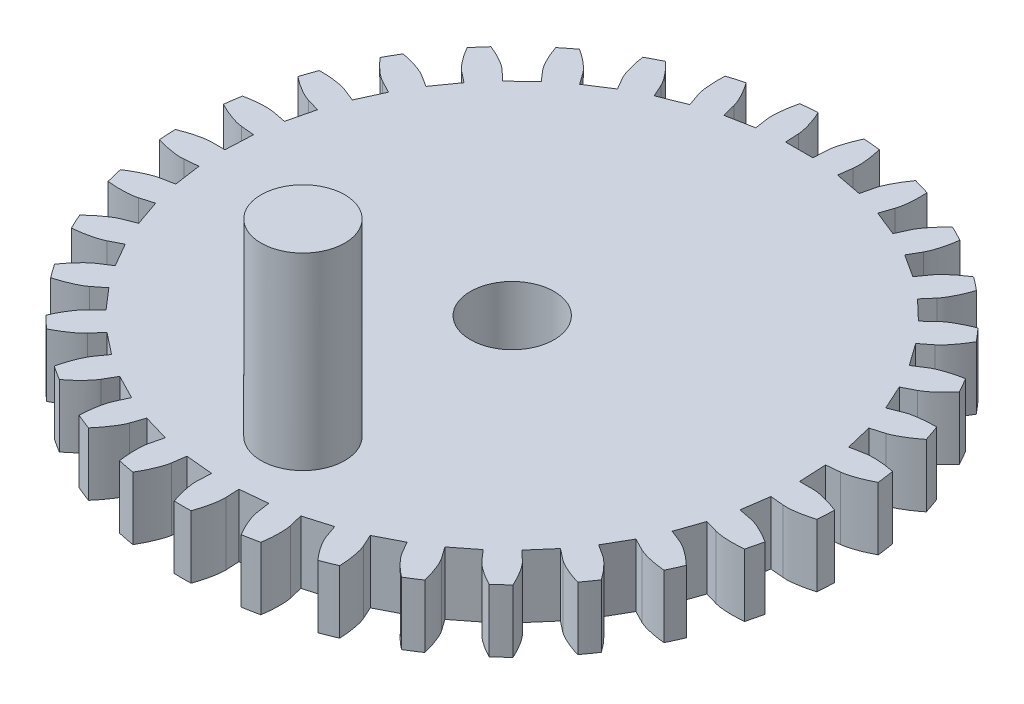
from build123d import *

# Parameters (mm, degrees)
BOSS_EXTRUDE1_DEPTH = 1.5
CIRPATTERN1_COUNT   = 33
SKETCH4_R           = 1
BOSS_EXTRUDE2_DEPTH = 4.5


with BuildPart() as part:
    # Sketch2 → Boss-Extrude1 (new body)
    with BuildSketch(Plane(origin=(0, 0, 0), x_dir=(1, 0, 0), z_dir=(0, 1, 0))):
        with BuildLine():
            Line((-7.155946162, -0.683310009), (-6.831426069, -0.652322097))
            Line((-6.831426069, -0.652322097), (-6.738485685, -1.298736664))
            Line((-6.738485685, -1.298736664), (-0.981928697, -0.189251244))
            ThreePointArc((-0.981928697, -0.189251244), (-0.995471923, -0.095056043), (-1, 0))
            Line((-1, 0), (-7.18849623, 0))
            add(Edge.make_bspline(
                [(-7.18849623, 0), (-7.203074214, 0), (-7.243921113, -0.001499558), (-7.320855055, -0.010246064), (-7.445189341, -0.032860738), (-7.601272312, -0.073783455), (-7.73077671, -0.11734324), (-7.82422035, -0.153296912), (-7.871543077, -0.172619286), (-7.873093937, -0.173253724)],
                knots=[0, 0, 0, 0, 0, 0.005376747, 0.015083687, 0.028531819, 0.046610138, 0.064854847, 0.065473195, 0.065473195, 0.065473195, 0.065473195, 0.065473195], degree=4))
            ThreePointArc((-7.873093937, -0.173253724), (-7.866080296, -0.374707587), (-7.853912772, -0.575915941))
            add(Edge.make_bspline(
                [(-7.155946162, -0.683310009), (-7.170458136, -0.684695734), (-7.21126262, -0.687085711), (-7.288679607, -0.685691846), (-7.414600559, -0.674998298), (-7.573866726, -0.649097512), (-7.706925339, -0.618045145), (-7.803363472, -0.591136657), (-7.852308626, -0.576400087), (-7.853912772, -0.575915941)],
                knots=[0, 0, 0, 0, 0, 0.005376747, 0.015083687, 0.028531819, 0.046610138, 0.064854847, 0.065473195, 0.065473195, 0.065473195, 0.065473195, 0.065473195], degree=4))
        make_face()
    boss_extrude1 = extrude(amount=BOSS_EXTRUDE1_DEPTH)

    # CirPattern1: Boss-Extrude1 ×33 about axis
    cirpattern1_axis = Axis((0, 0, 0), (0, -1, 0))
    for i in range(1, CIRPATTERN1_COUNT):
        add(boss_extrude1.rotate(cirpattern1_axis, i * 360 / CIRPATTERN1_COUNT))

    # Sketch4 → Boss-Extrude2 (add)
    with BuildSketch(Plane(origin=(0, 1.5, 0), x_dir=(1, 0, 0), z_dir=(0, 1, 0))):
        with Locations(Location((0, -5, 0), (0, 0, 90))):
            Circle(SKETCH4_R)
    extrude(amount=BOSS_EXTRUDE2_DEPTH)


solid = part.part
